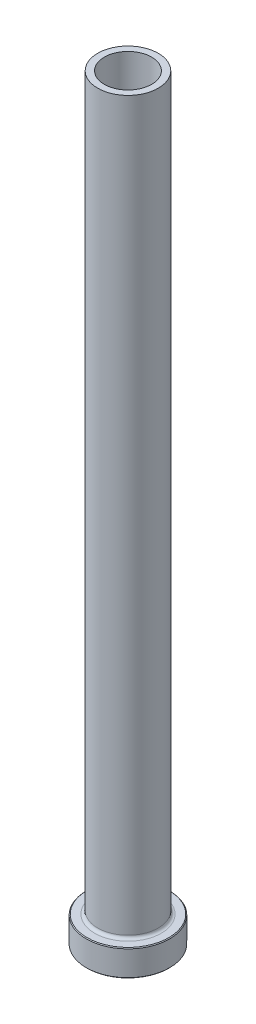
ISO-10303-21;
HEADER;
FILE_DESCRIPTION(('STEP AP214'),'2;1');
FILE_NAME('part.step','',(''),(''),'','','');
FILE_SCHEMA(('AUTOMOTIVE_DESIGN { 1 0 10303 214 1 1 1 1 }'));
ENDSEC;
DATA;
#1=APPLICATION_CONTEXT('core data for automotive mechanical design processes');
#2=APPLICATION_PROTOCOL_DEFINITION('international standard','automotive_design',2000,#1);
#3=PRODUCT_CONTEXT('',#1,'mechanical');
#4=PRODUCT('Part','Part','',(#3));
#5=PRODUCT_RELATED_PRODUCT_CATEGORY('part','',(#4));
#6=PRODUCT_DEFINITION_FORMATION('','',#4);
#7=PRODUCT_DEFINITION_CONTEXT('part definition',#1,'design');
#8=PRODUCT_DEFINITION('design','',#6,#7);
#9=PRODUCT_DEFINITION_SHAPE('','',#8);
#10=(LENGTH_UNIT() NAMED_UNIT(*) SI_UNIT(.MILLI.,.METRE.));
#11=(NAMED_UNIT(*) PLANE_ANGLE_UNIT() SI_UNIT($,.RADIAN.));
#12=(NAMED_UNIT(*) SI_UNIT($,.STERADIAN.) SOLID_ANGLE_UNIT());
#13=UNCERTAINTY_MEASURE_WITH_UNIT(LENGTH_MEASURE(1.E-05),#10,'distance_accuracy_value','');
#14=(GEOMETRIC_REPRESENTATION_CONTEXT(3) GLOBAL_UNCERTAINTY_ASSIGNED_CONTEXT((#13)) GLOBAL_UNIT_ASSIGNED_CONTEXT((#10,
#11,#12)) REPRESENTATION_CONTEXT('',''));
#15=CARTESIAN_POINT('',(0.,0.,0.));
#16=DIRECTION('',(0.,0.,1.));
#17=DIRECTION('',(1.,0.,0.));
#18=AXIS2_PLACEMENT_3D('',#15,#16,#17);
#19=CARTESIAN_POINT('',(0.,92.1876809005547,0.));
#20=DIRECTION('',(0.,1.,0.));
#21=DIRECTION('',(0.,0.,1.));
#22=AXIS2_PLACEMENT_3D('',#19,#20,#21);
#23=CYLINDRICAL_SURFACE('',#22,6.25);
#24=CARTESIAN_POINT('',(0.,200.,0.));
#25=DIRECTION('',(0.,1.,0.));
#26=DIRECTION('',(0.,0.,1.));
#27=AXIS2_PLACEMENT_3D('',#24,#25,#26);
#28=CIRCLE('',#27,6.25);
#29=CARTESIAN_POINT('',(0.,200.,6.25));
#30=VERTEX_POINT('',#29);
#31=EDGE_CURVE('E62',#30,#30,#28,.T.);
#32=ORIENTED_EDGE('',*,*,#31,.T.);
#33=EDGE_LOOP('',(#32));
#34=FACE_BOUND('',#33,.T.);
#35=CARTESIAN_POINT('',(0.,145.,0.));
#36=DIRECTION('',(0.,1.,0.));
#37=DIRECTION('',(0.,0.,1.));
#38=AXIS2_PLACEMENT_3D('',#35,#36,#37);
#39=CIRCLE('',#38,6.25);
#40=CARTESIAN_POINT('',(0.,145.,6.25));
#41=VERTEX_POINT('',#40);
#42=EDGE_CURVE('E71',#41,#41,#39,.T.);
#43=ORIENTED_EDGE('',*,*,#42,.F.);
#44=EDGE_LOOP('',(#43));
#45=FACE_BOUND('',#44,.T.);
#46=ADVANCED_FACE('F30',(#34,#45),#23,.F.);
#47=CARTESIAN_POINT('',(-6.25,200.,0.));
#48=DIRECTION('',(0.,1.,0.));
#49=DIRECTION('',(0.,0.,1.));
#50=AXIS2_PLACEMENT_3D('',#47,#48,#49);
#51=PLANE('',#50);
#52=CARTESIAN_POINT('',(0.,200.,0.));
#53=DIRECTION('',(0.,1.,0.));
#54=DIRECTION('',(0.,0.,1.));
#55=AXIS2_PLACEMENT_3D('',#52,#53,#54);
#56=CIRCLE('',#55,8.00000000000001);
#57=CARTESIAN_POINT('',(0.,200.,8.00000000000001));
#58=VERTEX_POINT('',#57);
#59=EDGE_CURVE('E65',#58,#58,#56,.T.);
#60=ORIENTED_EDGE('',*,*,#59,.T.);
#61=EDGE_LOOP('',(#60));
#62=FACE_BOUND('',#61,.T.);
#63=ORIENTED_EDGE('',*,*,#31,.F.);
#64=EDGE_LOOP('',(#63));
#65=FACE_BOUND('',#64,.T.);
#66=ADVANCED_FACE('F79',(#62,#65),#51,.T.);
#67=CARTESIAN_POINT('',(0.,92.1876809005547,0.));
#68=DIRECTION('',(0.,1.,0.));
#69=DIRECTION('',(0.,0.,1.));
#70=AXIS2_PLACEMENT_3D('',#67,#68,#69);
#71=CYLINDRICAL_SURFACE('',#70,8.);
#72=CARTESIAN_POINT('',(0.,7.8,0.));
#73=DIRECTION('',(0.,1.,0.));
#74=DIRECTION('',(0.,0.,1.));
#75=AXIS2_PLACEMENT_3D('',#72,#73,#74);
#76=CIRCLE('',#75,8.);
#77=CARTESIAN_POINT('',(0.,7.8,8.));
#78=VERTEX_POINT('',#77);
#79=EDGE_CURVE('E59',#78,#78,#76,.T.);
#80=ORIENTED_EDGE('',*,*,#79,.T.);
#81=EDGE_LOOP('',(#80));
#82=FACE_BOUND('',#81,.T.);
#83=ORIENTED_EDGE('',*,*,#59,.F.);
#84=EDGE_LOOP('',(#83));
#85=FACE_BOUND('',#84,.T.);
#86=ADVANCED_FACE('F85',(#82,#85),#71,.T.);
#87=CARTESIAN_POINT('',(-7.99999999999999,7.,0.));
#88=DIRECTION('',(0.,1.,0.));
#89=DIRECTION('',(0.,0.,1.));
#90=AXIS2_PLACEMENT_3D('',#87,#88,#89);
#91=PLANE('',#90);
#92=CARTESIAN_POINT('',(0.,7.,0.));
#93=DIRECTION('',(0.,1.,0.));
#94=DIRECTION('',(0.,0.,1.));
#95=AXIS2_PLACEMENT_3D('',#92,#93,#94);
#96=CIRCLE('',#95,10.8);
#97=CARTESIAN_POINT('',(0.,7.,10.8));
#98=VERTEX_POINT('',#97);
#99=EDGE_CURVE('E53',#98,#98,#96,.T.);
#100=ORIENTED_EDGE('',*,*,#99,.T.);
#101=EDGE_LOOP('',(#100));
#102=FACE_BOUND('',#101,.T.);
#103=CARTESIAN_POINT('',(0.,7.,0.));
#104=DIRECTION('',(0.,1.,0.));
#105=DIRECTION('',(0.,0.,1.));
#106=AXIS2_PLACEMENT_3D('',#103,#104,#105);
#107=CIRCLE('',#106,8.8);
#108=CARTESIAN_POINT('',(0.,7.,8.8));
#109=VERTEX_POINT('',#108);
#110=EDGE_CURVE('E56',#109,#109,#107,.F.);
#111=ORIENTED_EDGE('',*,*,#110,.T.);
#112=EDGE_LOOP('',(#111));
#113=FACE_BOUND('',#112,.T.);
#114=ADVANCED_FACE('F111',(#102,#113),#91,.T.);
#115=CARTESIAN_POINT('',(0.,92.1876809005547,0.));
#116=DIRECTION('',(0.,1.,0.));
#117=DIRECTION('',(0.,0.,1.));
#118=AXIS2_PLACEMENT_3D('',#115,#116,#117);
#119=CYLINDRICAL_SURFACE('',#118,11.);
#120=CARTESIAN_POINT('',(0.,6.79999999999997,0.));
#121=DIRECTION('',(0.,1.,0.));
#122=DIRECTION('',(0.,0.,1.));
#123=AXIS2_PLACEMENT_3D('',#120,#121,#122);
#124=CIRCLE('',#123,11.);
#125=CARTESIAN_POINT('',(0.,6.79999999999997,11.));
#126=VERTEX_POINT('',#125);
#127=EDGE_CURVE('E45',#126,#126,#124,.F.);
#128=ORIENTED_EDGE('',*,*,#127,.T.);
#129=EDGE_LOOP('',(#128));
#130=FACE_BOUND('',#129,.T.);
#131=CARTESIAN_POINT('',(0.,0.200000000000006,0.));
#132=DIRECTION('',(0.,-1.,0.));
#133=DIRECTION('',(0.,0.,-1.));
#134=AXIS2_PLACEMENT_3D('',#131,#132,#133);
#135=CIRCLE('',#134,11.);
#136=CARTESIAN_POINT('',(0.,0.200000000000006,-11.));
#137=VERTEX_POINT('',#136);
#138=EDGE_CURVE('E50',#137,#137,#135,.F.);
#139=ORIENTED_EDGE('',*,*,#138,.T.);
#140=EDGE_LOOP('',(#139));
#141=FACE_BOUND('',#140,.T.);
#142=ADVANCED_FACE('F108',(#130,#141),#119,.T.);
#143=CARTESIAN_POINT('',(-11.,0.,0.));
#144=DIRECTION('',(0.,-1.,0.));
#145=DIRECTION('',(0.,0.,-1.));
#146=AXIS2_PLACEMENT_3D('',#143,#144,#145);
#147=PLANE('',#146);
#148=CARTESIAN_POINT('',(0.,0.,0.));
#149=DIRECTION('',(0.,-1.,0.));
#150=DIRECTION('',(0.,0.,-1.));
#151=AXIS2_PLACEMENT_3D('',#148,#149,#150);
#152=CIRCLE('',#151,7.00000000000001);
#153=CARTESIAN_POINT('',(0.,0.,-7.00000000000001));
#154=VERTEX_POINT('',#153);
#155=EDGE_CURVE('E37',#154,#154,#152,.F.);
#156=ORIENTED_EDGE('',*,*,#155,.T.);
#157=EDGE_LOOP('',(#156));
#158=FACE_BOUND('',#157,.T.);
#159=CARTESIAN_POINT('',(0.,0.,0.));
#160=DIRECTION('',(0.,-1.,0.));
#161=DIRECTION('',(0.,0.,-1.));
#162=AXIS2_PLACEMENT_3D('',#159,#160,#161);
#163=CIRCLE('',#162,10.8);
#164=CARTESIAN_POINT('',(0.,0.,-10.8));
#165=VERTEX_POINT('',#164);
#166=EDGE_CURVE('E41',#165,#165,#163,.T.);
#167=ORIENTED_EDGE('',*,*,#166,.T.);
#168=EDGE_LOOP('',(#167));
#169=FACE_BOUND('',#168,.T.);
#170=ADVANCED_FACE('F110',(#158,#169),#147,.T.);
#171=CARTESIAN_POINT('',(0.,92.1876809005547,0.));
#172=DIRECTION('',(0.,1.,0.));
#173=DIRECTION('',(0.,0.,1.));
#174=AXIS2_PLACEMENT_3D('',#171,#172,#173);
#175=CYLINDRICAL_SURFACE('',#174,6.5);
#176=CARTESIAN_POINT('',(0.,0.500000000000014,0.));
#177=DIRECTION('',(0.,-1.,0.));
#178=DIRECTION('',(0.,0.,-1.));
#179=AXIS2_PLACEMENT_3D('',#176,#177,#178);
#180=CIRCLE('',#179,6.5);
#181=CARTESIAN_POINT('',(0.,0.500000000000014,-6.5));
#182=VERTEX_POINT('',#181);
#183=EDGE_CURVE('E10',#182,#182,#180,.T.);
#184=ORIENTED_EDGE('',*,*,#183,.T.);
#185=EDGE_LOOP('',(#184));
#186=FACE_BOUND('',#185,.T.);
#187=CARTESIAN_POINT('',(0.,133.,0.));
#188=DIRECTION('',(0.,1.,0.));
#189=DIRECTION('',(0.,0.,1.));
#190=AXIS2_PLACEMENT_3D('',#187,#188,#189);
#191=CIRCLE('',#190,6.50000000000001);
#192=CARTESIAN_POINT('',(0.,133.,6.50000000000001));
#193=VERTEX_POINT('',#192);
#194=EDGE_CURVE('E68',#193,#193,#191,.T.);
#195=ORIENTED_EDGE('',*,*,#194,.T.);
#196=EDGE_LOOP('',(#195));
#197=FACE_BOUND('',#196,.T.);
#198=ADVANCED_FACE('F118',(#186,#197),#175,.F.);
#199=CARTESIAN_POINT('',(0.,133.,0.));
#200=DIRECTION('',(0.,-1.,0.));
#201=DIRECTION('',(0.,0.,-1.));
#202=AXIS2_PLACEMENT_3D('',#199,#200,#201);
#203=CONICAL_SURFACE('',#202,6.50000000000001,0.0208303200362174);
#204=ORIENTED_EDGE('',*,*,#42,.T.);
#205=EDGE_LOOP('',(#204));
#206=FACE_BOUND('',#205,.T.);
#207=ORIENTED_EDGE('',*,*,#194,.F.);
#208=EDGE_LOOP('',(#207));
#209=FACE_BOUND('',#208,.T.);
#210=ADVANCED_FACE('F75',(#206,#209),#203,.F.);
#211=CARTESIAN_POINT('',(0.,7.8,0.));
#212=DIRECTION('',(0.,1.,0.));
#213=DIRECTION('',(0.,0.,1.));
#214=AXIS2_PLACEMENT_3D('',#211,#212,#213);
#215=TOROIDAL_SURFACE('',#214,8.8,0.8);
#216=ORIENTED_EDGE('',*,*,#110,.F.);
#217=EDGE_LOOP('',(#216));
#218=FACE_BOUND('',#217,.T.);
#219=ORIENTED_EDGE('',*,*,#79,.F.);
#220=EDGE_LOOP('',(#219));
#221=FACE_BOUND('',#220,.T.);
#222=ADVANCED_FACE('F90',(#218,#221),#215,.F.);
#223=CARTESIAN_POINT('',(0.,7.00000000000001,0.));
#224=DIRECTION('',(0.,-1.,0.));
#225=DIRECTION('',(0.,0.,-1.));
#226=AXIS2_PLACEMENT_3D('',#223,#224,#225);
#227=CONICAL_SURFACE('',#226,10.7999999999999,0.785398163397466);
#228=ORIENTED_EDGE('',*,*,#127,.F.);
#229=EDGE_LOOP('',(#228));
#230=FACE_BOUND('',#229,.T.);
#231=ORIENTED_EDGE('',*,*,#99,.F.);
#232=EDGE_LOOP('',(#231));
#233=FACE_BOUND('',#232,.T.);
#234=ADVANCED_FACE('F93',(#230,#233),#227,.T.);
#235=CARTESIAN_POINT('',(0.,0.200000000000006,0.));
#236=DIRECTION('',(0.,1.,0.));
#237=DIRECTION('',(0.,0.,1.));
#238=AXIS2_PLACEMENT_3D('',#235,#236,#237);
#239=CONICAL_SURFACE('',#238,11.,0.785398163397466);
#240=ORIENTED_EDGE('',*,*,#166,.F.);
#241=EDGE_LOOP('',(#240));
#242=FACE_BOUND('',#241,.T.);
#243=ORIENTED_EDGE('',*,*,#138,.F.);
#244=EDGE_LOOP('',(#243));
#245=FACE_BOUND('',#244,.T.);
#246=ADVANCED_FACE('F96',(#242,#245),#239,.T.);
#247=CARTESIAN_POINT('',(0.,0.,0.));
#248=DIRECTION('',(0.,-1.,0.));
#249=DIRECTION('',(0.,0.,-1.));
#250=AXIS2_PLACEMENT_3D('',#247,#248,#249);
#251=CONICAL_SURFACE('',#250,7.00000000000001,0.785398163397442);
#252=ORIENTED_EDGE('',*,*,#183,.F.);
#253=EDGE_LOOP('',(#252));
#254=FACE_BOUND('',#253,.T.);
#255=ORIENTED_EDGE('',*,*,#155,.F.);
#256=EDGE_LOOP('',(#255));
#257=FACE_BOUND('',#256,.T.);
#258=ADVANCED_FACE('F32',(#254,#257),#251,.F.);
#259=CLOSED_SHELL('',(#46,#66,#86,#114,#142,#170,#198,#210,#222,#234,#246,#258));
#260=MANIFOLD_SOLID_BREP('B2',#259);
#261=ADVANCED_BREP_SHAPE_REPRESENTATION('',(#18,#260),#14);
#262=SHAPE_DEFINITION_REPRESENTATION(#9,#261);
ENDSEC;
END-ISO-10303-21;
